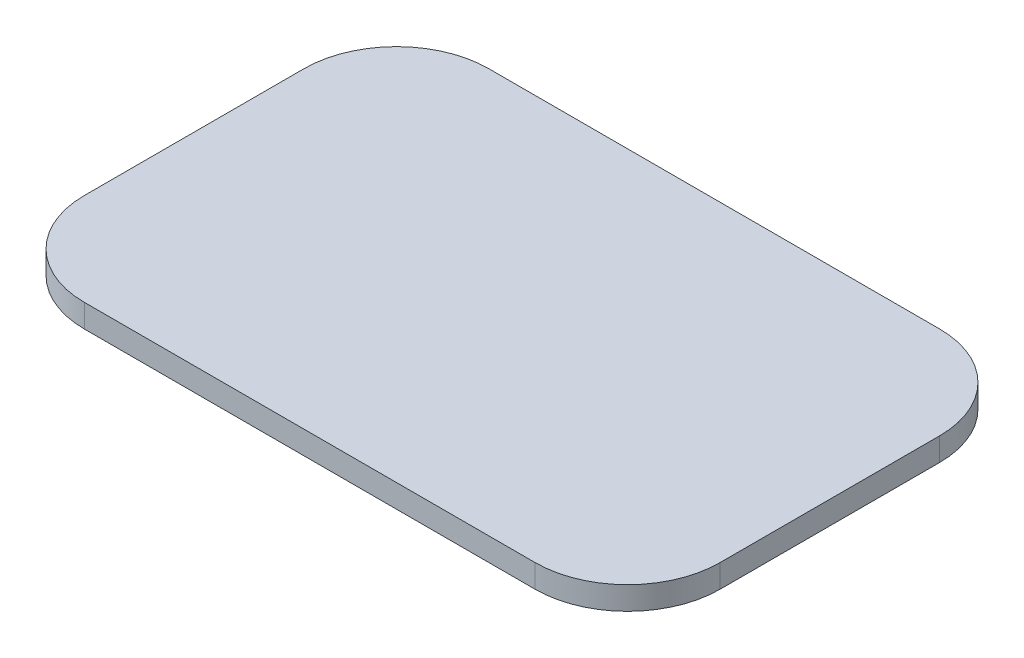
from build123d import *

# Parameters (mm, degrees)
BOSS_EXTRUDE1_DEPTH = 2


with BuildPart() as part:
    # Sketch1 → Boss-Extrude1 (new body)
    with BuildSketch(Plane(origin=(0, 0, 0), x_dir=(1, 0, 0), z_dir=(0, 1, 0))):
        with BuildLine():
            Line((-19.5, -17.5), (19.5, -17.5))
            ThreePointArc((19.5, -17.5), (25.156854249, -15.156854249), (27.5, -9.5))
            Line((27.5, -9.5), (27.5, 9.5))
            ThreePointArc((27.5, 9.5), (25.156854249, 15.156854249), (19.5, 17.5))
            Line((19.5, 17.5), (-19.5, 17.5))
            ThreePointArc((-19.5, 17.5), (-25.156854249, 15.156854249), (-27.5, 9.5))
            Line((-27.5, 9.5), (-27.5, -9.5))
            ThreePointArc((-27.5, -9.5), (-25.156854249, -15.156854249), (-19.5, -17.5))
        make_face()
    extrude(amount=BOSS_EXTRUDE1_DEPTH)


solid = part.part
